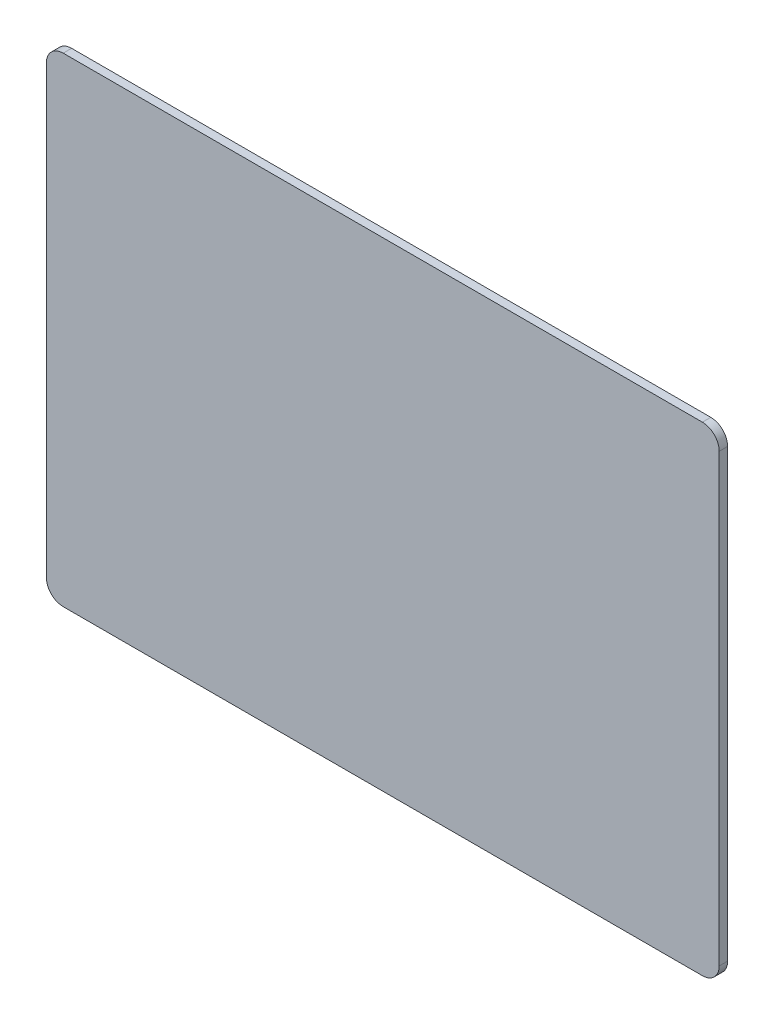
ISO-10303-21;
HEADER;
FILE_DESCRIPTION(('STEP AP214'),'2;1');
FILE_NAME('part.step','',(''),(''),'','','');
FILE_SCHEMA(('AUTOMOTIVE_DESIGN { 1 0 10303 214 1 1 1 1 }'));
ENDSEC;
DATA;
#1=APPLICATION_CONTEXT('core data for automotive mechanical design processes');
#2=APPLICATION_PROTOCOL_DEFINITION('international standard','automotive_design',2000,#1);
#3=PRODUCT_CONTEXT('',#1,'mechanical');
#4=PRODUCT('Part','Part','',(#3));
#5=PRODUCT_RELATED_PRODUCT_CATEGORY('part','',(#4));
#6=PRODUCT_DEFINITION_FORMATION('','',#4);
#7=PRODUCT_DEFINITION_CONTEXT('part definition',#1,'design');
#8=PRODUCT_DEFINITION('design','',#6,#7);
#9=PRODUCT_DEFINITION_SHAPE('','',#8);
#10=(LENGTH_UNIT() NAMED_UNIT(*) SI_UNIT(.MILLI.,.METRE.));
#11=(NAMED_UNIT(*) PLANE_ANGLE_UNIT() SI_UNIT($,.RADIAN.));
#12=(NAMED_UNIT(*) SI_UNIT($,.STERADIAN.) SOLID_ANGLE_UNIT());
#13=UNCERTAINTY_MEASURE_WITH_UNIT(LENGTH_MEASURE(1.E-05),#10,'distance_accuracy_value','');
#14=(GEOMETRIC_REPRESENTATION_CONTEXT(3) GLOBAL_UNCERTAINTY_ASSIGNED_CONTEXT((#13)) GLOBAL_UNIT_ASSIGNED_CONTEXT((#10,
#11,#12)) REPRESENTATION_CONTEXT('',''));
#15=CARTESIAN_POINT('',(0.,0.,0.));
#16=DIRECTION('',(0.,0.,1.));
#17=DIRECTION('',(1.,0.,0.));
#18=AXIS2_PLACEMENT_3D('',#15,#16,#17);
#19=CARTESIAN_POINT('',(-3.,-3.,2.));
#20=DIRECTION('',(1.,0.,0.));
#21=DIRECTION('',(0.,0.,-1.));
#22=AXIS2_PLACEMENT_3D('',#19,#20,#21);
#23=PLANE('',#22);
#24=DIRECTION('',(0.,0.,-1.));
#25=VECTOR('',#24,1.);
#26=CARTESIAN_POINT('',(-3.,52.,2.));
#27=LINE('',#26,#25);
#28=CARTESIAN_POINT('',(-3.,52.,2.));
#29=VERTEX_POINT('',#28);
#30=CARTESIAN_POINT('',(-3.,52.,1.));
#31=VERTEX_POINT('',#30);
#32=EDGE_CURVE('E196',#29,#31,#27,.T.);
#33=ORIENTED_EDGE('',*,*,#32,.T.);
#34=DIRECTION('',(0.,-1.,0.));
#35=VECTOR('',#34,1.);
#36=CARTESIAN_POINT('',(-3.,-3.,1.));
#37=LINE('',#36,#35);
#38=CARTESIAN_POINT('',(-3.,-1.,1.));
#39=VERTEX_POINT('',#38);
#40=EDGE_CURVE('E58',#31,#39,#37,.T.);
#41=ORIENTED_EDGE('',*,*,#40,.T.);
#42=DIRECTION('',(0.,0.,-1.));
#43=VECTOR('',#42,1.);
#44=CARTESIAN_POINT('',(-3.,-1.,2.));
#45=LINE('',#44,#43);
#46=CARTESIAN_POINT('',(-3.,-1.,2.));
#47=VERTEX_POINT('',#46);
#48=EDGE_CURVE('E199',#39,#47,#45,.F.);
#49=ORIENTED_EDGE('',*,*,#48,.T.);
#50=DIRECTION('',(0.,-1.,0.));
#51=VECTOR('',#50,1.);
#52=CARTESIAN_POINT('',(-3.,-3.,2.));
#53=LINE('',#52,#51);
#54=EDGE_CURVE('E179',#29,#47,#53,.T.);
#55=ORIENTED_EDGE('',*,*,#54,.F.);
#56=EDGE_LOOP('',(#33,#41,#49,#55));
#57=FACE_BOUND('',#56,.T.);
#58=ADVANCED_FACE('F36',(#57),#23,.F.);
#59=CARTESIAN_POINT('',(-3.,-3.,2.));
#60=DIRECTION('',(0.,1.,0.));
#61=DIRECTION('',(0.,0.,1.));
#62=AXIS2_PLACEMENT_3D('',#59,#60,#61);
#63=PLANE('',#62);
#64=DIRECTION('',(0.,0.,-1.));
#65=VECTOR('',#64,1.);
#66=CARTESIAN_POINT('',(-1.,-3.,2.));
#67=LINE('',#66,#65);
#68=CARTESIAN_POINT('',(-1.,-3.,2.));
#69=VERTEX_POINT('',#68);
#70=CARTESIAN_POINT('',(-1.,-3.,1.));
#71=VERTEX_POINT('',#70);
#72=EDGE_CURVE('E193',#69,#71,#67,.T.);
#73=ORIENTED_EDGE('',*,*,#72,.T.);
#74=DIRECTION('',(1.,0.,0.));
#75=VECTOR('',#74,1.);
#76=CARTESIAN_POINT('',(-3.,-3.,1.));
#77=LINE('',#76,#75);
#78=CARTESIAN_POINT('',(75.,-3.,1.));
#79=VERTEX_POINT('',#78);
#80=EDGE_CURVE('E174',#71,#79,#77,.T.);
#81=ORIENTED_EDGE('',*,*,#80,.T.);
#82=DIRECTION('',(0.,0.,-1.));
#83=VECTOR('',#82,1.);
#84=CARTESIAN_POINT('',(75.,-3.,2.));
#85=LINE('',#84,#83);
#86=CARTESIAN_POINT('',(75.,-3.,2.));
#87=VERTEX_POINT('',#86);
#88=EDGE_CURVE('E191',#79,#87,#85,.F.);
#89=ORIENTED_EDGE('',*,*,#88,.T.);
#90=DIRECTION('',(1.,0.,0.));
#91=VECTOR('',#90,1.);
#92=CARTESIAN_POINT('',(-3.,-3.,2.));
#93=LINE('',#92,#91);
#94=EDGE_CURVE('E182',#69,#87,#93,.T.);
#95=ORIENTED_EDGE('',*,*,#94,.F.);
#96=EDGE_LOOP('',(#73,#81,#89,#95));
#97=FACE_BOUND('',#96,.T.);
#98=ADVANCED_FACE('F239',(#97),#63,.F.);
#99=CARTESIAN_POINT('',(77.,-3.,2.));
#100=DIRECTION('',(-1.,0.,0.));
#101=DIRECTION('',(0.,0.,1.));
#102=AXIS2_PLACEMENT_3D('',#99,#100,#101);
#103=PLANE('',#102);
#104=DIRECTION('',(0.,0.,-1.));
#105=VECTOR('',#104,1.);
#106=CARTESIAN_POINT('',(77.,-1.,2.));
#107=LINE('',#106,#105);
#108=CARTESIAN_POINT('',(77.,-1.,2.));
#109=VERTEX_POINT('',#108);
#110=CARTESIAN_POINT('',(77.,-1.,1.));
#111=VERTEX_POINT('',#110);
#112=EDGE_CURVE('E211',#109,#111,#107,.T.);
#113=ORIENTED_EDGE('',*,*,#112,.T.);
#114=DIRECTION('',(0.,1.,0.));
#115=VECTOR('',#114,1.);
#116=CARTESIAN_POINT('',(77.,-3.,1.));
#117=LINE('',#116,#115);
#118=CARTESIAN_POINT('',(77.,52.,1.));
#119=VERTEX_POINT('',#118);
#120=EDGE_CURVE('E171',#111,#119,#117,.T.);
#121=ORIENTED_EDGE('',*,*,#120,.T.);
#122=DIRECTION('',(0.,0.,-1.));
#123=VECTOR('',#122,1.);
#124=CARTESIAN_POINT('',(77.,52.,2.));
#125=LINE('',#124,#123);
#126=CARTESIAN_POINT('',(77.,52.,2.));
#127=VERTEX_POINT('',#126);
#128=EDGE_CURVE('E209',#119,#127,#125,.F.);
#129=ORIENTED_EDGE('',*,*,#128,.T.);
#130=DIRECTION('',(0.,1.,0.));
#131=VECTOR('',#130,1.);
#132=CARTESIAN_POINT('',(77.,-3.,2.));
#133=LINE('',#132,#131);
#134=EDGE_CURVE('E185',#109,#127,#133,.T.);
#135=ORIENTED_EDGE('',*,*,#134,.F.);
#136=EDGE_LOOP('',(#113,#121,#129,#135));
#137=FACE_BOUND('',#136,.T.);
#138=ADVANCED_FACE('F230',(#137),#103,.F.);
#139=CARTESIAN_POINT('',(-3.,54.,2.));
#140=DIRECTION('',(0.,-1.,0.));
#141=DIRECTION('',(0.,0.,-1.));
#142=AXIS2_PLACEMENT_3D('',#139,#140,#141);
#143=PLANE('',#142);
#144=DIRECTION('',(0.,0.,-1.));
#145=VECTOR('',#144,1.);
#146=CARTESIAN_POINT('',(75.,54.,2.));
#147=LINE('',#146,#145);
#148=CARTESIAN_POINT('',(75.,54.,2.));
#149=VERTEX_POINT('',#148);
#150=CARTESIAN_POINT('',(75.,54.,1.));
#151=VERTEX_POINT('',#150);
#152=EDGE_CURVE('E44',#149,#151,#147,.T.);
#153=ORIENTED_EDGE('',*,*,#152,.T.);
#154=DIRECTION('',(-1.,0.,0.));
#155=VECTOR('',#154,1.);
#156=CARTESIAN_POINT('',(-3.,54.,1.));
#157=LINE('',#156,#155);
#158=CARTESIAN_POINT('',(-1.,54.,1.));
#159=VERTEX_POINT('',#158);
#160=EDGE_CURVE('E134',#151,#159,#157,.T.);
#161=ORIENTED_EDGE('',*,*,#160,.T.);
#162=DIRECTION('',(0.,0.,-1.));
#163=VECTOR('',#162,1.);
#164=CARTESIAN_POINT('',(-1.,54.,2.));
#165=LINE('',#164,#163);
#166=CARTESIAN_POINT('',(-1.,54.,2.));
#167=VERTEX_POINT('',#166);
#168=EDGE_CURVE('E214',#159,#167,#165,.F.);
#169=ORIENTED_EDGE('',*,*,#168,.T.);
#170=DIRECTION('',(-1.,0.,0.));
#171=VECTOR('',#170,1.);
#172=CARTESIAN_POINT('',(-3.,54.,2.));
#173=LINE('',#172,#171);
#174=EDGE_CURVE('E188',#149,#167,#173,.T.);
#175=ORIENTED_EDGE('',*,*,#174,.F.);
#176=EDGE_LOOP('',(#153,#161,#169,#175));
#177=FACE_BOUND('',#176,.T.);
#178=ADVANCED_FACE('F219',(#177),#143,.F.);
#179=CARTESIAN_POINT('',(0.,0.,2.));
#180=DIRECTION('',(0.,0.,-1.));
#181=DIRECTION('',(-1.,0.,0.));
#182=AXIS2_PLACEMENT_3D('',#179,#180,#181);
#183=PLANE('',#182);
#184=ORIENTED_EDGE('',*,*,#54,.T.);
#185=CARTESIAN_POINT('',(-1.,-1.,2.));
#186=DIRECTION('',(0.,0.,-1.));
#187=DIRECTION('',(-1.,0.,0.));
#188=AXIS2_PLACEMENT_3D('',#185,#186,#187);
#189=CIRCLE('',#188,2.);
#190=EDGE_CURVE('E207',#47,#69,#189,.F.);
#191=ORIENTED_EDGE('',*,*,#190,.T.);
#192=ORIENTED_EDGE('',*,*,#94,.T.);
#193=CARTESIAN_POINT('',(75.,-1.,2.));
#194=DIRECTION('',(0.,0.,-1.));
#195=DIRECTION('',(-1.,0.,0.));
#196=AXIS2_PLACEMENT_3D('',#193,#194,#195);
#197=CIRCLE('',#196,2.);
#198=EDGE_CURVE('E205',#87,#109,#197,.F.);
#199=ORIENTED_EDGE('',*,*,#198,.T.);
#200=ORIENTED_EDGE('',*,*,#134,.T.);
#201=CARTESIAN_POINT('',(75.,52.,2.));
#202=DIRECTION('',(0.,0.,-1.));
#203=DIRECTION('',(-1.,0.,0.));
#204=AXIS2_PLACEMENT_3D('',#201,#202,#203);
#205=CIRCLE('',#204,2.);
#206=EDGE_CURVE('E203',#127,#149,#205,.F.);
#207=ORIENTED_EDGE('',*,*,#206,.T.);
#208=ORIENTED_EDGE('',*,*,#174,.T.);
#209=CARTESIAN_POINT('',(-1.,52.,2.));
#210=DIRECTION('',(0.,0.,-1.));
#211=DIRECTION('',(-1.,0.,0.));
#212=AXIS2_PLACEMENT_3D('',#209,#210,#211);
#213=CIRCLE('',#212,2.);
#214=EDGE_CURVE('E201',#167,#29,#213,.F.);
#215=ORIENTED_EDGE('',*,*,#214,.T.);
#216=EDGE_LOOP('',(#184,#191,#192,#199,#200,#207,#208,#215));
#217=FACE_BOUND('',#216,.T.);
#218=ADVANCED_FACE('F252',(#217),#183,.F.);
#219=CARTESIAN_POINT('',(-1.,-1.,2.));
#220=DIRECTION('',(0.,0.,-1.));
#221=DIRECTION('',(-1.,0.,0.));
#222=AXIS2_PLACEMENT_3D('',#219,#220,#221);
#223=CYLINDRICAL_SURFACE('',#222,2.);
#224=CARTESIAN_POINT('',(-1.,-1.,1.));
#225=DIRECTION('',(0.,0.,1.));
#226=DIRECTION('',(1.,0.,0.));
#227=AXIS2_PLACEMENT_3D('',#224,#225,#226);
#228=CIRCLE('',#227,2.);
#229=EDGE_CURVE('E169',#71,#39,#228,.F.);
#230=ORIENTED_EDGE('',*,*,#229,.F.);
#231=ORIENTED_EDGE('',*,*,#72,.F.);
#232=ORIENTED_EDGE('',*,*,#190,.F.);
#233=ORIENTED_EDGE('',*,*,#48,.F.);
#234=EDGE_LOOP('',(#230,#231,#232,#233));
#235=FACE_BOUND('',#234,.T.);
#236=ADVANCED_FACE('F244',(#235),#223,.T.);
#237=CARTESIAN_POINT('',(75.,-1.,2.));
#238=DIRECTION('',(0.,0.,-1.));
#239=DIRECTION('',(-1.,0.,0.));
#240=AXIS2_PLACEMENT_3D('',#237,#238,#239);
#241=CYLINDRICAL_SURFACE('',#240,2.);
#242=CARTESIAN_POINT('',(75.,-1.,1.));
#243=DIRECTION('',(0.,0.,1.));
#244=DIRECTION('',(1.,0.,0.));
#245=AXIS2_PLACEMENT_3D('',#242,#243,#244);
#246=CIRCLE('',#245,2.);
#247=EDGE_CURVE('E177',#111,#79,#246,.F.);
#248=ORIENTED_EDGE('',*,*,#247,.F.);
#249=ORIENTED_EDGE('',*,*,#112,.F.);
#250=ORIENTED_EDGE('',*,*,#198,.F.);
#251=ORIENTED_EDGE('',*,*,#88,.F.);
#252=EDGE_LOOP('',(#248,#249,#250,#251));
#253=FACE_BOUND('',#252,.T.);
#254=ADVANCED_FACE('F235',(#253),#241,.T.);
#255=CARTESIAN_POINT('',(75.,52.,2.));
#256=DIRECTION('',(0.,0.,-1.));
#257=DIRECTION('',(-1.,0.,0.));
#258=AXIS2_PLACEMENT_3D('',#255,#256,#257);
#259=CYLINDRICAL_SURFACE('',#258,2.);
#260=CARTESIAN_POINT('',(75.,52.,1.));
#261=DIRECTION('',(0.,0.,1.));
#262=DIRECTION('',(1.,0.,0.));
#263=AXIS2_PLACEMENT_3D('',#260,#261,#262);
#264=CIRCLE('',#263,2.);
#265=EDGE_CURVE('E167',#151,#119,#264,.F.);
#266=ORIENTED_EDGE('',*,*,#265,.F.);
#267=ORIENTED_EDGE('',*,*,#152,.F.);
#268=ORIENTED_EDGE('',*,*,#206,.F.);
#269=ORIENTED_EDGE('',*,*,#128,.F.);
#270=EDGE_LOOP('',(#266,#267,#268,#269));
#271=FACE_BOUND('',#270,.T.);
#272=ADVANCED_FACE('F224',(#271),#259,.T.);
#273=CARTESIAN_POINT('',(-1.,52.,2.));
#274=DIRECTION('',(0.,0.,-1.));
#275=DIRECTION('',(-1.,0.,0.));
#276=AXIS2_PLACEMENT_3D('',#273,#274,#275);
#277=CYLINDRICAL_SURFACE('',#276,2.);
#278=CARTESIAN_POINT('',(-1.,52.,1.));
#279=DIRECTION('',(0.,0.,1.));
#280=DIRECTION('',(1.,0.,0.));
#281=AXIS2_PLACEMENT_3D('',#278,#279,#280);
#282=CIRCLE('',#281,2.);
#283=EDGE_CURVE('E12',#31,#159,#282,.F.);
#284=ORIENTED_EDGE('',*,*,#283,.F.);
#285=ORIENTED_EDGE('',*,*,#32,.F.);
#286=ORIENTED_EDGE('',*,*,#214,.F.);
#287=ORIENTED_EDGE('',*,*,#168,.F.);
#288=EDGE_LOOP('',(#284,#285,#286,#287));
#289=FACE_BOUND('',#288,.T.);
#290=ADVANCED_FACE('F38',(#289),#277,.T.);
#291=CARTESIAN_POINT('',(37.,25.5,1.));
#292=DIRECTION('',(0.,0.,1.));
#293=DIRECTION('',(1.,0.,0.));
#294=AXIS2_PLACEMENT_3D('',#291,#292,#293);
#295=PLANE('',#294);
#296=ORIENTED_EDGE('',*,*,#247,.T.);
#297=ORIENTED_EDGE('',*,*,#80,.F.);
#298=ORIENTED_EDGE('',*,*,#229,.T.);
#299=ORIENTED_EDGE('',*,*,#40,.F.);
#300=ORIENTED_EDGE('',*,*,#283,.T.);
#301=ORIENTED_EDGE('',*,*,#160,.F.);
#302=ORIENTED_EDGE('',*,*,#265,.T.);
#303=ORIENTED_EDGE('',*,*,#120,.F.);
#304=EDGE_LOOP('',(#296,#297,#298,#299,#300,#301,#302,#303));
#305=FACE_BOUND('',#304,.T.);
#306=DIRECTION('',(1.,0.,0.));
#307=VECTOR('',#306,1.);
#308=CARTESIAN_POINT('',(0.,-0.0174550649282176,1.));
#309=LINE('',#308,#307);
#310=CARTESIAN_POINT('',(-0.0174550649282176,-0.0174550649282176,1.));
#311=VERTEX_POINT('',#310);
#312=CARTESIAN_POINT('',(74.0174550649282,-0.0174550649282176,1.));
#313=VERTEX_POINT('',#312);
#314=EDGE_CURVE('E131',#311,#313,#309,.T.);
#315=ORIENTED_EDGE('',*,*,#314,.T.);
#316=DIRECTION('',(0.,1.,0.));
#317=VECTOR('',#316,1.);
#318=CARTESIAN_POINT('',(74.0174550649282,0.,1.));
#319=LINE('',#318,#317);
#320=CARTESIAN_POINT('',(74.0174550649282,51.0174550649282,1.));
#321=VERTEX_POINT('',#320);
#322=EDGE_CURVE('E160',#313,#321,#319,.T.);
#323=ORIENTED_EDGE('',*,*,#322,.T.);
#324=DIRECTION('',(-1.,0.,0.));
#325=VECTOR('',#324,1.);
#326=CARTESIAN_POINT('',(0.,51.0174550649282,1.));
#327=LINE('',#326,#325);
#328=CARTESIAN_POINT('',(-0.0174550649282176,51.0174550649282,1.));
#329=VERTEX_POINT('',#328);
#330=EDGE_CURVE('E154',#321,#329,#327,.T.);
#331=ORIENTED_EDGE('',*,*,#330,.T.);
#332=DIRECTION('',(0.,-1.,0.));
#333=VECTOR('',#332,1.);
#334=CARTESIAN_POINT('',(-0.0174550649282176,0.,1.));
#335=LINE('',#334,#333);
#336=EDGE_CURVE('E152',#329,#311,#335,.T.);
#337=ORIENTED_EDGE('',*,*,#336,.T.);
#338=EDGE_LOOP('',(#315,#323,#331,#337));
#339=FACE_BOUND('',#338,.T.);
#340=ADVANCED_FACE('F226',(#305,#339),#295,.F.);
#341=CARTESIAN_POINT('',(0.,0.,0.));
#342=DIRECTION('',(0.999847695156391,0.,0.0174524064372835));
#343=DIRECTION('',(0.0174524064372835,0.,-0.999847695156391));
#344=AXIS2_PLACEMENT_3D('',#341,#342,#343);
#345=PLANE('',#344);
#346=DIRECTION('',(0.,-1.,0.));
#347=VECTOR('',#346,1.);
#348=CARTESIAN_POINT('',(0.,0.,0.));
#349=LINE('',#348,#347);
#350=CARTESIAN_POINT('',(0.,51.,0.));
#351=VERTEX_POINT('',#350);
#352=CARTESIAN_POINT('',(0.,0.,0.));
#353=VERTEX_POINT('',#352);
#354=EDGE_CURVE('E138',#351,#353,#349,.T.);
#355=ORIENTED_EDGE('',*,*,#354,.T.);
#356=DIRECTION('',(0.0174497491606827,0.0174497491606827,-0.999695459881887));
#357=VECTOR('',#356,1.);
#358=CARTESIAN_POINT('',(0.,0.,0.));
#359=LINE('',#358,#357);
#360=EDGE_CURVE('E125',#311,#353,#359,.T.);
#361=ORIENTED_EDGE('',*,*,#360,.F.);
#362=ORIENTED_EDGE('',*,*,#336,.F.);
#363=DIRECTION('',(0.0174497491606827,-0.0174497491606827,-0.999695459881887));
#364=VECTOR('',#363,1.);
#365=CARTESIAN_POINT('',(0.0155291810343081,50.9844708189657,-0.889666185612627));
#366=LINE('',#365,#364);
#367=EDGE_CURVE('E141',#329,#351,#366,.T.);
#368=ORIENTED_EDGE('',*,*,#367,.T.);
#369=EDGE_LOOP('',(#355,#361,#362,#368));
#370=FACE_BOUND('',#369,.T.);
#371=ADVANCED_FACE('F139',(#370),#345,.F.);
#372=CARTESIAN_POINT('',(0.,0.,0.));
#373=DIRECTION('',(0.,0.999847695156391,0.0174524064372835));
#374=DIRECTION('',(0.,-0.0174524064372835,0.999847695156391));
#375=AXIS2_PLACEMENT_3D('',#372,#373,#374);
#376=PLANE('',#375);
#377=DIRECTION('',(1.,0.,0.));
#378=VECTOR('',#377,1.);
#379=CARTESIAN_POINT('',(0.,0.,0.));
#380=LINE('',#379,#378);
#381=CARTESIAN_POINT('',(74.,0.,0.));
#382=VERTEX_POINT('',#381);
#383=EDGE_CURVE('E130',#353,#382,#380,.T.);
#384=ORIENTED_EDGE('',*,*,#383,.T.);
#385=DIRECTION('',(-0.0174497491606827,0.0174497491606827,-0.999695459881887));
#386=VECTOR('',#385,1.);
#387=CARTESIAN_POINT('',(74.,0.,0.));
#388=LINE('',#387,#386);
#389=EDGE_CURVE('E135',#313,#382,#388,.T.);
#390=ORIENTED_EDGE('',*,*,#389,.F.);
#391=ORIENTED_EDGE('',*,*,#314,.F.);
#392=ORIENTED_EDGE('',*,*,#360,.T.);
#393=EDGE_LOOP('',(#384,#390,#391,#392));
#394=FACE_BOUND('',#393,.T.);
#395=ADVANCED_FACE('F127',(#394),#376,.F.);
#396=CARTESIAN_POINT('',(74.,0.,0.));
#397=DIRECTION('',(-0.999847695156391,0.,0.0174524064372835));
#398=DIRECTION('',(0.0174524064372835,0.,0.999847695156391));
#399=AXIS2_PLACEMENT_3D('',#396,#397,#398);
#400=PLANE('',#399);
#401=DIRECTION('',(0.,1.,0.));
#402=VECTOR('',#401,1.);
#403=CARTESIAN_POINT('',(74.,0.,0.));
#404=LINE('',#403,#402);
#405=CARTESIAN_POINT('',(74.,51.,0.));
#406=VERTEX_POINT('',#405);
#407=EDGE_CURVE('E51',#382,#406,#404,.T.);
#408=ORIENTED_EDGE('',*,*,#407,.T.);
#409=DIRECTION('',(-0.0174497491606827,-0.0174497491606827,-0.999695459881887));
#410=VECTOR('',#409,1.);
#411=CARTESIAN_POINT('',(73.977467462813,50.977467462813,-1.29088819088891));
#412=LINE('',#411,#410);
#413=EDGE_CURVE('E153',#321,#406,#412,.T.);
#414=ORIENTED_EDGE('',*,*,#413,.F.);
#415=ORIENTED_EDGE('',*,*,#322,.F.);
#416=ORIENTED_EDGE('',*,*,#389,.T.);
#417=EDGE_LOOP('',(#408,#414,#415,#416));
#418=FACE_BOUND('',#417,.T.);
#419=ADVANCED_FACE('F287',(#418),#400,.F.);
#420=CARTESIAN_POINT('',(0.,51.,0.));
#421=DIRECTION('',(0.,-0.999847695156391,0.0174524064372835));
#422=DIRECTION('',(0.,-0.0174524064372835,-0.999847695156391));
#423=AXIS2_PLACEMENT_3D('',#420,#421,#422);
#424=PLANE('',#423);
#425=DIRECTION('',(-1.,0.,0.));
#426=VECTOR('',#425,1.);
#427=CARTESIAN_POINT('',(0.,51.,0.));
#428=LINE('',#427,#426);
#429=EDGE_CURVE('E148',#406,#351,#428,.T.);
#430=ORIENTED_EDGE('',*,*,#429,.T.);
#431=ORIENTED_EDGE('',*,*,#367,.F.);
#432=ORIENTED_EDGE('',*,*,#330,.F.);
#433=ORIENTED_EDGE('',*,*,#413,.T.);
#434=EDGE_LOOP('',(#430,#431,#432,#433));
#435=FACE_BOUND('',#434,.T.);
#436=ADVANCED_FACE('F289',(#435),#424,.F.);
#437=CARTESIAN_POINT('',(0.,0.,0.));
#438=DIRECTION('',(0.,0.,-1.));
#439=DIRECTION('',(-1.,0.,0.));
#440=AXIS2_PLACEMENT_3D('',#437,#438,#439);
#441=PLANE('',#440);
#442=ORIENTED_EDGE('',*,*,#354,.F.);
#443=ORIENTED_EDGE('',*,*,#429,.F.);
#444=ORIENTED_EDGE('',*,*,#407,.F.);
#445=ORIENTED_EDGE('',*,*,#383,.F.);
#446=EDGE_LOOP('',(#442,#443,#444,#445));
#447=FACE_BOUND('',#446,.T.);
#448=ADVANCED_FACE('F146',(#447),#441,.T.);
#449=CLOSED_SHELL('',(#58,#98,#138,#178,#218,#236,#254,#272,#290,#340,#371,#395,#419,#436,#448));
#450=MANIFOLD_SOLID_BREP('B2',#449);
#451=ADVANCED_BREP_SHAPE_REPRESENTATION('',(#18,#450),#14);
#452=SHAPE_DEFINITION_REPRESENTATION(#9,#451);
ENDSEC;
END-ISO-10303-21;
